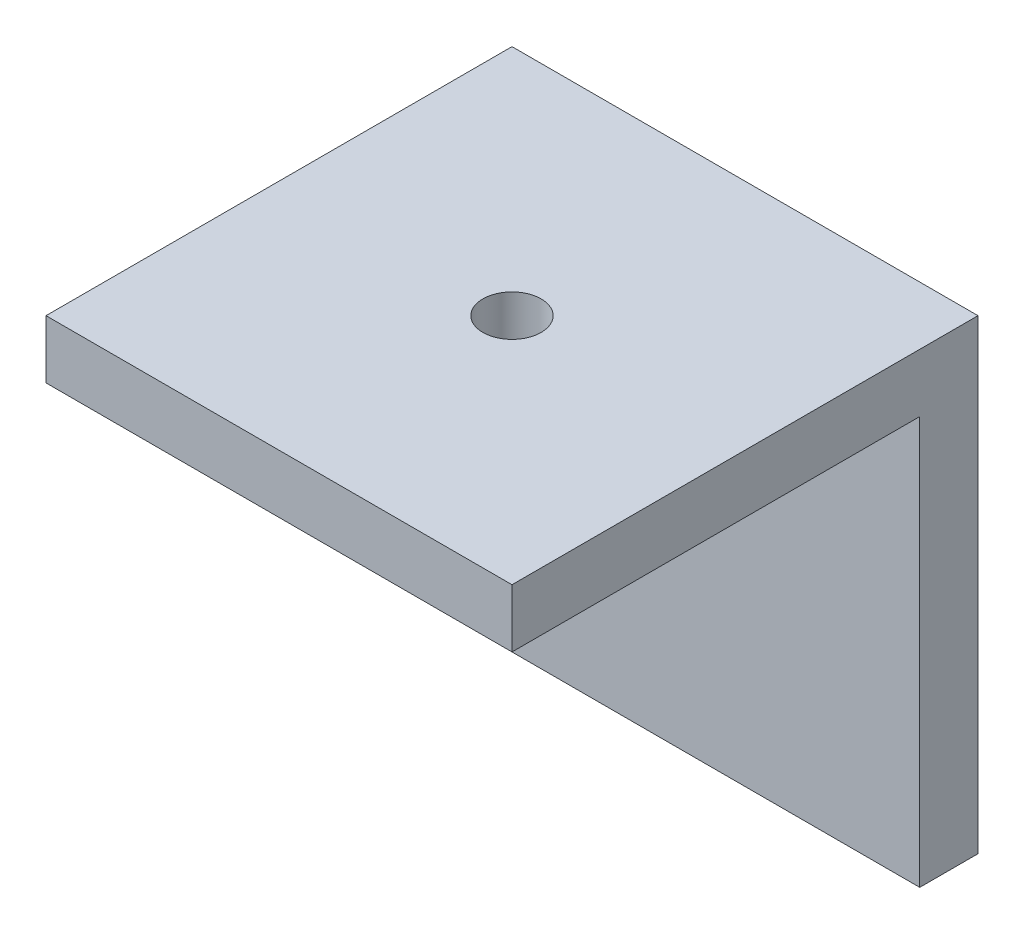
ISO-10303-21;
HEADER;
FILE_DESCRIPTION(('STEP AP214'),'2;1');
FILE_NAME('part.step','',(''),(''),'','','');
FILE_SCHEMA(('AUTOMOTIVE_DESIGN { 1 0 10303 214 1 1 1 1 }'));
ENDSEC;
DATA;
#1=APPLICATION_CONTEXT('core data for automotive mechanical design processes');
#2=APPLICATION_PROTOCOL_DEFINITION('international standard','automotive_design',2000,#1);
#3=PRODUCT_CONTEXT('',#1,'mechanical');
#4=PRODUCT('Part','Part','',(#3));
#5=PRODUCT_RELATED_PRODUCT_CATEGORY('part','',(#4));
#6=PRODUCT_DEFINITION_FORMATION('','',#4);
#7=PRODUCT_DEFINITION_CONTEXT('part definition',#1,'design');
#8=PRODUCT_DEFINITION('design','',#6,#7);
#9=PRODUCT_DEFINITION_SHAPE('','',#8);
#10=(LENGTH_UNIT() NAMED_UNIT(*) SI_UNIT(.MILLI.,.METRE.));
#11=(NAMED_UNIT(*) PLANE_ANGLE_UNIT() SI_UNIT($,.RADIAN.));
#12=(NAMED_UNIT(*) SI_UNIT($,.STERADIAN.) SOLID_ANGLE_UNIT());
#13=UNCERTAINTY_MEASURE_WITH_UNIT(LENGTH_MEASURE(1.E-05),#10,'distance_accuracy_value','');
#14=(GEOMETRIC_REPRESENTATION_CONTEXT(3) GLOBAL_UNCERTAINTY_ASSIGNED_CONTEXT((#13)) GLOBAL_UNIT_ASSIGNED_CONTEXT((#10,
#11,#12)) REPRESENTATION_CONTEXT('',''));
#15=CARTESIAN_POINT('',(0.,0.,0.));
#16=DIRECTION('',(0.,0.,1.));
#17=DIRECTION('',(1.,0.,0.));
#18=AXIS2_PLACEMENT_3D('',#15,#16,#17);
#19=CARTESIAN_POINT('',(0.,0.,3.175));
#20=DIRECTION('',(0.,0.,1.));
#21=DIRECTION('',(1.,0.,0.));
#22=AXIS2_PLACEMENT_3D('',#19,#20,#21);
#23=PLANE('',#22);
#24=DIRECTION('',(1.,0.,0.));
#25=VECTOR('',#24,1.);
#26=CARTESIAN_POINT('',(-12.7,9.525,3.175));
#27=LINE('',#26,#25);
#28=CARTESIAN_POINT('',(-12.7,9.525,3.175));
#29=VERTEX_POINT('',#28);
#30=CARTESIAN_POINT('',(12.7,9.525,3.175));
#31=VERTEX_POINT('',#30);
#32=EDGE_CURVE('E53',#29,#31,#27,.T.);
#33=ORIENTED_EDGE('',*,*,#32,.F.);
#34=DIRECTION('',(0.,-1.,0.));
#35=VECTOR('',#34,1.);
#36=CARTESIAN_POINT('',(-12.7,-12.7,3.175));
#37=LINE('',#36,#35);
#38=CARTESIAN_POINT('',(-12.7,-12.7,3.175));
#39=VERTEX_POINT('',#38);
#40=EDGE_CURVE('E90',#29,#39,#37,.T.);
#41=ORIENTED_EDGE('',*,*,#40,.T.);
#42=DIRECTION('',(1.,0.,0.));
#43=VECTOR('',#42,1.);
#44=CARTESIAN_POINT('',(12.7,-12.7,3.175));
#45=LINE('',#44,#43);
#46=CARTESIAN_POINT('',(12.7,-12.7,3.175));
#47=VERTEX_POINT('',#46);
#48=EDGE_CURVE('E59',#39,#47,#45,.T.);
#49=ORIENTED_EDGE('',*,*,#48,.T.);
#50=DIRECTION('',(0.,1.,0.));
#51=VECTOR('',#50,1.);
#52=CARTESIAN_POINT('',(12.7,-12.7,3.175));
#53=LINE('',#52,#51);
#54=EDGE_CURVE('E101',#47,#31,#53,.T.);
#55=ORIENTED_EDGE('',*,*,#54,.T.);
#56=EDGE_LOOP('',(#33,#41,#49,#55));
#57=FACE_BOUND('',#56,.T.);
#58=CARTESIAN_POINT('',(0.,0.,3.175));
#59=DIRECTION('',(0.,0.,1.));
#60=DIRECTION('',(1.,0.,0.));
#61=AXIS2_PLACEMENT_3D('',#58,#59,#60);
#62=CIRCLE('',#61,1.5875);
#63=CARTESIAN_POINT('',(1.58750000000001,0.,3.175));
#64=VERTEX_POINT('',#63);
#65=EDGE_CURVE('E106',#64,#64,#62,.T.);
#66=ORIENTED_EDGE('',*,*,#65,.F.);
#67=EDGE_LOOP('',(#66));
#68=FACE_BOUND('',#67,.T.);
#69=ADVANCED_FACE('F37',(#57,#68),#23,.T.);
#70=CARTESIAN_POINT('',(0.,0.,0.));
#71=DIRECTION('',(0.,0.,1.));
#72=DIRECTION('',(1.,0.,0.));
#73=AXIS2_PLACEMENT_3D('',#70,#71,#72);
#74=PLANE('',#73);
#75=DIRECTION('',(0.,-1.,0.));
#76=VECTOR('',#75,1.);
#77=CARTESIAN_POINT('',(-12.7,-12.7,0.));
#78=LINE('',#77,#76);
#79=CARTESIAN_POINT('',(-12.7,12.7,0.));
#80=VERTEX_POINT('',#79);
#81=CARTESIAN_POINT('',(-12.7,-12.7,0.));
#82=VERTEX_POINT('',#81);
#83=EDGE_CURVE('E97',#80,#82,#78,.T.);
#84=ORIENTED_EDGE('',*,*,#83,.F.);
#85=DIRECTION('',(-1.,0.,0.));
#86=VECTOR('',#85,1.);
#87=CARTESIAN_POINT('',(12.7,12.7,0.));
#88=LINE('',#87,#86);
#89=CARTESIAN_POINT('',(12.7,12.7,0.));
#90=VERTEX_POINT('',#89);
#91=EDGE_CURVE('E79',#90,#80,#88,.T.);
#92=ORIENTED_EDGE('',*,*,#91,.F.);
#93=DIRECTION('',(0.,1.,0.));
#94=VECTOR('',#93,1.);
#95=CARTESIAN_POINT('',(12.7,-12.7,0.));
#96=LINE('',#95,#94);
#97=CARTESIAN_POINT('',(12.7,-12.7,0.));
#98=VERTEX_POINT('',#97);
#99=EDGE_CURVE('E91',#98,#90,#96,.T.);
#100=ORIENTED_EDGE('',*,*,#99,.F.);
#101=DIRECTION('',(1.,0.,0.));
#102=VECTOR('',#101,1.);
#103=CARTESIAN_POINT('',(12.7,-12.7,0.));
#104=LINE('',#103,#102);
#105=EDGE_CURVE('E105',#82,#98,#104,.T.);
#106=ORIENTED_EDGE('',*,*,#105,.F.);
#107=EDGE_LOOP('',(#84,#92,#100,#106));
#108=FACE_BOUND('',#107,.T.);
#109=CARTESIAN_POINT('',(0.,0.,0.));
#110=DIRECTION('',(0.,0.,1.));
#111=DIRECTION('',(1.,0.,0.));
#112=AXIS2_PLACEMENT_3D('',#109,#110,#111);
#113=CIRCLE('',#112,1.5875);
#114=CARTESIAN_POINT('',(1.58750000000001,0.,0.));
#115=VERTEX_POINT('',#114);
#116=EDGE_CURVE('E110',#115,#115,#113,.T.);
#117=ORIENTED_EDGE('',*,*,#116,.T.);
#118=EDGE_LOOP('',(#117));
#119=FACE_BOUND('',#118,.T.);
#120=ADVANCED_FACE('F103',(#108,#119),#74,.F.);
#121=CARTESIAN_POINT('',(-12.7,-12.7,3.175));
#122=DIRECTION('',(1.,0.,0.));
#123=DIRECTION('',(0.,0.,-1.));
#124=AXIS2_PLACEMENT_3D('',#121,#122,#123);
#125=PLANE('',#124);
#126=ORIENTED_EDGE('',*,*,#83,.T.);
#127=DIRECTION('',(0.,0.,-1.));
#128=VECTOR('',#127,1.);
#129=CARTESIAN_POINT('',(-12.7,-12.7,3.175));
#130=LINE('',#129,#128);
#131=EDGE_CURVE('E11',#39,#82,#130,.T.);
#132=ORIENTED_EDGE('',*,*,#131,.F.);
#133=ORIENTED_EDGE('',*,*,#40,.F.);
#134=DIRECTION('',(0.,0.,-1.));
#135=VECTOR('',#134,1.);
#136=CARTESIAN_POINT('',(-12.7,9.525,25.4));
#137=LINE('',#136,#135);
#138=CARTESIAN_POINT('',(-12.7,9.525,25.4));
#139=VERTEX_POINT('',#138);
#140=EDGE_CURVE('E126',#139,#29,#137,.T.);
#141=ORIENTED_EDGE('',*,*,#140,.F.);
#142=DIRECTION('',(0.,-1.,0.));
#143=VECTOR('',#142,1.);
#144=CARTESIAN_POINT('',(-12.7,12.7,25.4));
#145=LINE('',#144,#143);
#146=CARTESIAN_POINT('',(-12.7,12.7,25.4));
#147=VERTEX_POINT('',#146);
#148=EDGE_CURVE('E100',#147,#139,#145,.T.);
#149=ORIENTED_EDGE('',*,*,#148,.F.);
#150=DIRECTION('',(0.,0.,-1.));
#151=VECTOR('',#150,1.);
#152=CARTESIAN_POINT('',(-12.7,12.7,3.175));
#153=LINE('',#152,#151);
#154=EDGE_CURVE('E83',#147,#80,#153,.T.);
#155=ORIENTED_EDGE('',*,*,#154,.T.);
#156=EDGE_LOOP('',(#126,#132,#133,#141,#149,#155));
#157=FACE_BOUND('',#156,.T.);
#158=ADVANCED_FACE('F39',(#157),#125,.F.);
#159=CARTESIAN_POINT('',(12.7,-12.7,3.175));
#160=DIRECTION('',(0.,1.,0.));
#161=DIRECTION('',(0.,0.,1.));
#162=AXIS2_PLACEMENT_3D('',#159,#160,#161);
#163=PLANE('',#162);
#164=ORIENTED_EDGE('',*,*,#105,.T.);
#165=DIRECTION('',(0.,0.,-1.));
#166=VECTOR('',#165,1.);
#167=CARTESIAN_POINT('',(12.7,-12.7,3.175));
#168=LINE('',#167,#166);
#169=EDGE_CURVE('E46',#47,#98,#168,.T.);
#170=ORIENTED_EDGE('',*,*,#169,.F.);
#171=ORIENTED_EDGE('',*,*,#48,.F.);
#172=ORIENTED_EDGE('',*,*,#131,.T.);
#173=EDGE_LOOP('',(#164,#170,#171,#172));
#174=FACE_BOUND('',#173,.T.);
#175=ADVANCED_FACE('F123',(#174),#163,.F.);
#176=CARTESIAN_POINT('',(12.7,-12.7,3.175));
#177=DIRECTION('',(-1.,0.,0.));
#178=DIRECTION('',(0.,0.,1.));
#179=AXIS2_PLACEMENT_3D('',#176,#177,#178);
#180=PLANE('',#179);
#181=ORIENTED_EDGE('',*,*,#99,.T.);
#182=DIRECTION('',(0.,0.,-1.));
#183=VECTOR('',#182,1.);
#184=CARTESIAN_POINT('',(12.7,12.7,3.175));
#185=LINE('',#184,#183);
#186=CARTESIAN_POINT('',(12.7,12.7,25.4));
#187=VERTEX_POINT('',#186);
#188=EDGE_CURVE('E86',#187,#90,#185,.T.);
#189=ORIENTED_EDGE('',*,*,#188,.F.);
#190=DIRECTION('',(0.,1.,0.));
#191=VECTOR('',#190,1.);
#192=CARTESIAN_POINT('',(12.7,12.7,25.4));
#193=LINE('',#192,#191);
#194=CARTESIAN_POINT('',(12.7,9.525,25.4));
#195=VERTEX_POINT('',#194);
#196=EDGE_CURVE('E153',#195,#187,#193,.T.);
#197=ORIENTED_EDGE('',*,*,#196,.F.);
#198=DIRECTION('',(0.,0.,-1.));
#199=VECTOR('',#198,1.);
#200=CARTESIAN_POINT('',(12.7,9.525,25.4));
#201=LINE('',#200,#199);
#202=EDGE_CURVE('E135',#195,#31,#201,.T.);
#203=ORIENTED_EDGE('',*,*,#202,.T.);
#204=ORIENTED_EDGE('',*,*,#54,.F.);
#205=ORIENTED_EDGE('',*,*,#169,.T.);
#206=EDGE_LOOP('',(#181,#189,#197,#203,#204,#205));
#207=FACE_BOUND('',#206,.T.);
#208=ADVANCED_FACE('F120',(#207),#180,.F.);
#209=CARTESIAN_POINT('',(12.7,12.7,3.175));
#210=DIRECTION('',(0.,-1.,0.));
#211=DIRECTION('',(0.,0.,-1.));
#212=AXIS2_PLACEMENT_3D('',#209,#210,#211);
#213=PLANE('',#212);
#214=CARTESIAN_POINT('',(0.,12.7,12.7));
#215=DIRECTION('',(0.,1.,0.));
#216=DIRECTION('',(0.,0.,1.));
#217=AXIS2_PLACEMENT_3D('',#214,#215,#216);
#218=CIRCLE('',#217,1.5875);
#219=CARTESIAN_POINT('',(0.,12.7,14.2875));
#220=VERTEX_POINT('',#219);
#221=EDGE_CURVE('E159',#220,#220,#218,.T.);
#222=ORIENTED_EDGE('',*,*,#221,.F.);
#223=EDGE_LOOP('',(#222));
#224=FACE_BOUND('',#223,.T.);
#225=ORIENTED_EDGE('',*,*,#91,.T.);
#226=ORIENTED_EDGE('',*,*,#154,.F.);
#227=DIRECTION('',(-1.,0.,0.));
#228=VECTOR('',#227,1.);
#229=CARTESIAN_POINT('',(-12.7,12.7,25.4));
#230=LINE('',#229,#228);
#231=EDGE_CURVE('E139',#187,#147,#230,.T.);
#232=ORIENTED_EDGE('',*,*,#231,.F.);
#233=ORIENTED_EDGE('',*,*,#188,.T.);
#234=EDGE_LOOP('',(#225,#226,#232,#233));
#235=FACE_BOUND('',#234,.T.);
#236=ADVANCED_FACE('F81',(#224,#235),#213,.F.);
#237=CARTESIAN_POINT('',(0.,0.,3.175));
#238=DIRECTION('',(0.,0.,-1.));
#239=DIRECTION('',(-1.,0.,0.));
#240=AXIS2_PLACEMENT_3D('',#237,#238,#239);
#241=CYLINDRICAL_SURFACE('',#240,1.5875);
#242=ORIENTED_EDGE('',*,*,#65,.T.);
#243=EDGE_LOOP('',(#242));
#244=FACE_BOUND('',#243,.T.);
#245=ORIENTED_EDGE('',*,*,#116,.F.);
#246=EDGE_LOOP('',(#245));
#247=FACE_BOUND('',#246,.T.);
#248=ADVANCED_FACE('F170',(#244,#247),#241,.F.);
#249=CARTESIAN_POINT('',(-12.7,9.525,25.4));
#250=DIRECTION('',(0.,1.,0.));
#251=DIRECTION('',(0.,0.,1.));
#252=AXIS2_PLACEMENT_3D('',#249,#250,#251);
#253=PLANE('',#252);
#254=CARTESIAN_POINT('',(0.,9.525,12.7));
#255=DIRECTION('',(0.,1.,0.));
#256=DIRECTION('',(0.,0.,1.));
#257=AXIS2_PLACEMENT_3D('',#254,#255,#256);
#258=CIRCLE('',#257,1.5875);
#259=CARTESIAN_POINT('',(0.,9.525,14.2875));
#260=VERTEX_POINT('',#259);
#261=EDGE_CURVE('E41',#260,#260,#258,.T.);
#262=ORIENTED_EDGE('',*,*,#261,.T.);
#263=EDGE_LOOP('',(#262));
#264=FACE_BOUND('',#263,.T.);
#265=ORIENTED_EDGE('',*,*,#32,.T.);
#266=ORIENTED_EDGE('',*,*,#202,.F.);
#267=DIRECTION('',(1.,0.,0.));
#268=VECTOR('',#267,1.);
#269=CARTESIAN_POINT('',(-12.7,9.525,25.4));
#270=LINE('',#269,#268);
#271=EDGE_CURVE('E134',#139,#195,#270,.T.);
#272=ORIENTED_EDGE('',*,*,#271,.F.);
#273=ORIENTED_EDGE('',*,*,#140,.T.);
#274=EDGE_LOOP('',(#265,#266,#272,#273));
#275=FACE_BOUND('',#274,.T.);
#276=ADVANCED_FACE('F130',(#264,#275),#253,.F.);
#277=CARTESIAN_POINT('',(0.,0.,25.4));
#278=DIRECTION('',(0.,0.,1.));
#279=DIRECTION('',(1.,0.,0.));
#280=AXIS2_PLACEMENT_3D('',#277,#278,#279);
#281=PLANE('',#280);
#282=ORIENTED_EDGE('',*,*,#148,.T.);
#283=ORIENTED_EDGE('',*,*,#271,.T.);
#284=ORIENTED_EDGE('',*,*,#196,.T.);
#285=ORIENTED_EDGE('',*,*,#231,.T.);
#286=EDGE_LOOP('',(#282,#283,#284,#285));
#287=FACE_BOUND('',#286,.T.);
#288=ADVANCED_FACE('F151',(#287),#281,.T.);
#289=CARTESIAN_POINT('',(0.,-9.525,12.7));
#290=DIRECTION('',(0.,1.,0.));
#291=DIRECTION('',(0.,0.,1.));
#292=AXIS2_PLACEMENT_3D('',#289,#290,#291);
#293=CYLINDRICAL_SURFACE('',#292,1.5875);
#294=ORIENTED_EDGE('',*,*,#221,.T.);
#295=EDGE_LOOP('',(#294));
#296=FACE_BOUND('',#295,.T.);
#297=ORIENTED_EDGE('',*,*,#261,.F.);
#298=EDGE_LOOP('',(#297));
#299=FACE_BOUND('',#298,.T.);
#300=ADVANCED_FACE('F166',(#296,#299),#293,.F.);
#301=CLOSED_SHELL('',(#69,#120,#158,#175,#208,#236,#248,#276,#288,#300));
#302=MANIFOLD_SOLID_BREP('B2',#301);
#303=ADVANCED_BREP_SHAPE_REPRESENTATION('',(#18,#302),#14);
#304=SHAPE_DEFINITION_REPRESENTATION(#9,#303);
ENDSEC;
END-ISO-10303-21;
